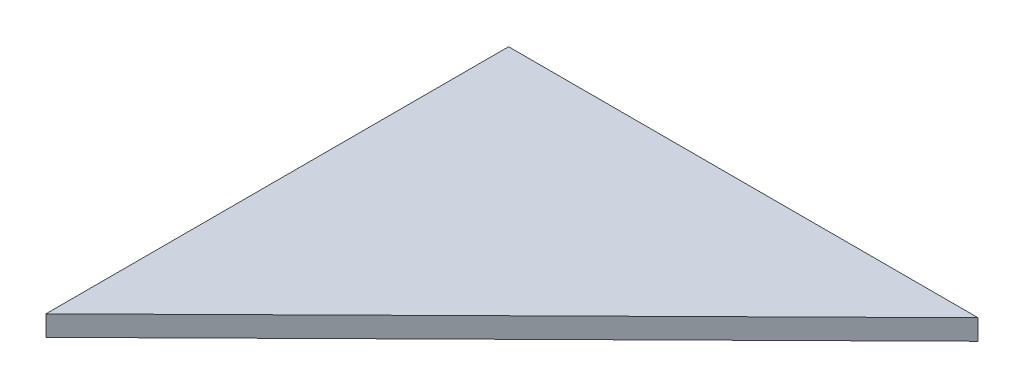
from build123d import *

# Parameters (mm, degrees)
EXTRUSION1_DEPTH = 3


with BuildPart() as part:
    # Esquisse1 → Extrusion1 (new body)
    with BuildSketch(Plane(origin=(0, 0, 0), x_dir=(1, 0, 0), z_dir=(0, 1, 0))):
        Polygon((0, 0), (0, -68), (69, 0), align=None)
    extrude(amount=EXTRUSION1_DEPTH)


solid = part.part
